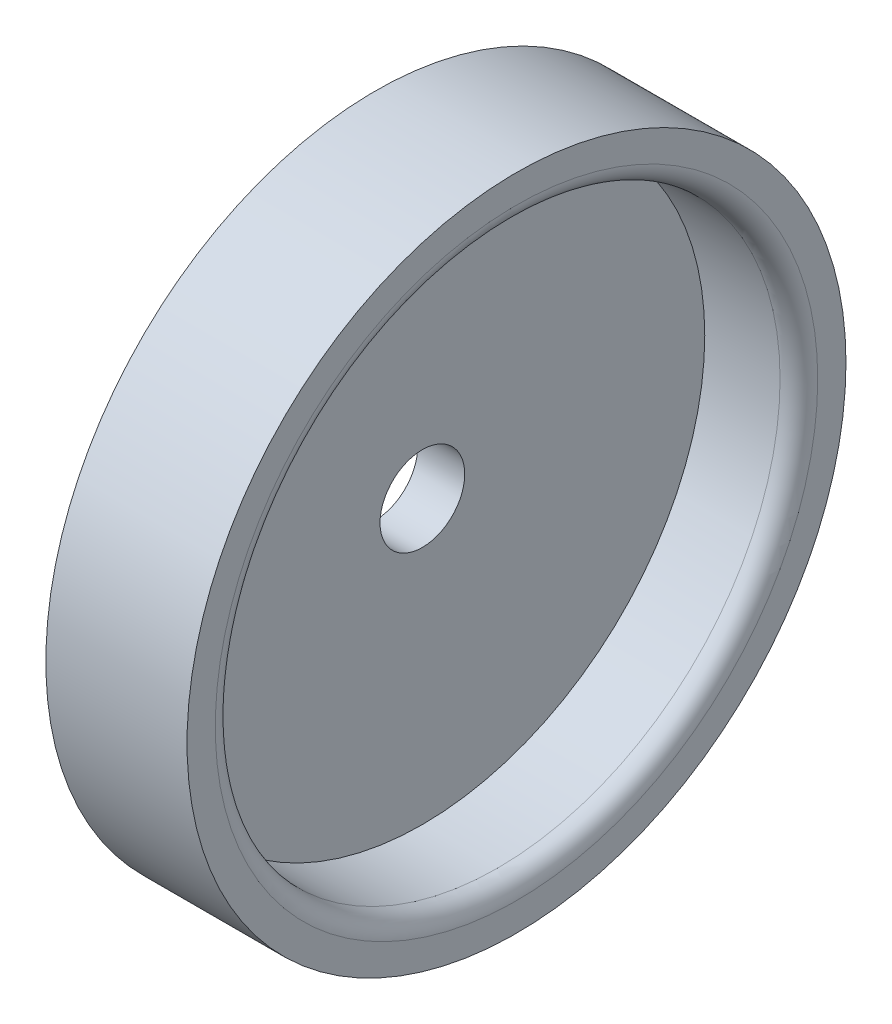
from build123d import *

# Parameters (mm, degrees)
VERRUNDUNG1_R             = 2
M10X1_0_GEWINDEBOHRUNG1_D = 9


with BuildPart() as part:
    # Skizze1 → Rotation1 (revolve)
    with BuildSketch(Plane.XY, mode=Mode.PRIVATE) as rotation1_sk:
        Polygon((0, 0), (0, 30), (10, 30), (10, 35), (-5, 35), (-5, 0), align=None)
    revolve(rotation1_sk.sketch.rotate(Axis((0, 0, 0), (-1, 0, 0)), 90), axis=Axis((0, 0, 0), (-1, 0, 0)))

    # Verrundung1
    verrundung1_edges = [part.edges().sort_by_distance(p)[0] for p in [
        (10, 0, 30),
    ]]
    fillet(verrundung1_edges, radius=VERRUNDUNG1_R)

    # M10x1.0 Gewindebohrung1 (through all)
    with Locations(Plane.ZY.offset(5)):
        with Locations((0, 0)):
            Hole(M10X1_0_GEWINDEBOHRUNG1_D / 2)


solid = part.part
